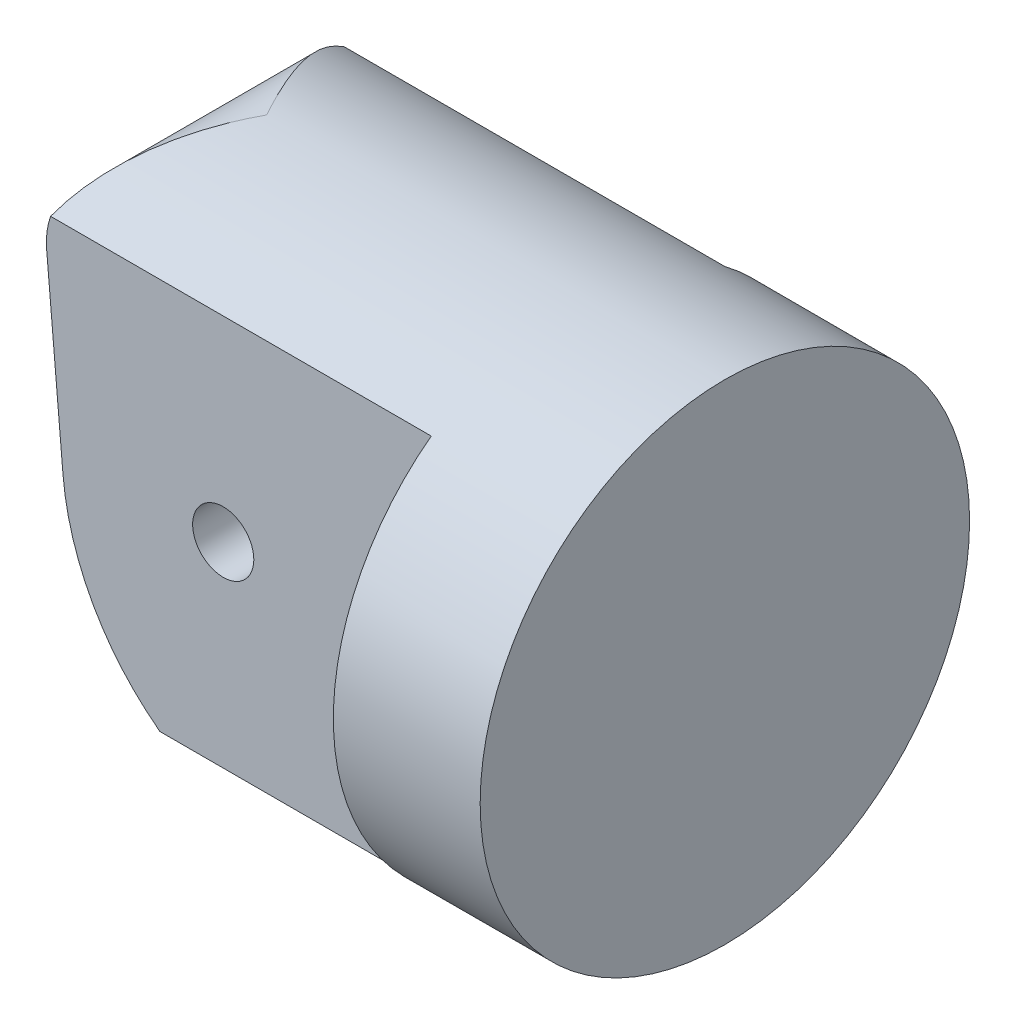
ISO-10303-21;
HEADER;
FILE_DESCRIPTION(('STEP AP214'),'2;1');
FILE_NAME('part.step','',(''),(''),'','','');
FILE_SCHEMA(('AUTOMOTIVE_DESIGN { 1 0 10303 214 1 1 1 1 }'));
ENDSEC;
DATA;
#1=APPLICATION_CONTEXT('core data for automotive mechanical design processes');
#2=APPLICATION_PROTOCOL_DEFINITION('international standard','automotive_design',2000,#1);
#3=PRODUCT_CONTEXT('',#1,'mechanical');
#4=PRODUCT('Part','Part','',(#3));
#5=PRODUCT_RELATED_PRODUCT_CATEGORY('part','',(#4));
#6=PRODUCT_DEFINITION_FORMATION('','',#4);
#7=PRODUCT_DEFINITION_CONTEXT('part definition',#1,'design');
#8=PRODUCT_DEFINITION('design','',#6,#7);
#9=PRODUCT_DEFINITION_SHAPE('','',#8);
#10=(LENGTH_UNIT() NAMED_UNIT(*) SI_UNIT(.MILLI.,.METRE.));
#11=(NAMED_UNIT(*) PLANE_ANGLE_UNIT() SI_UNIT($,.RADIAN.));
#12=(NAMED_UNIT(*) SI_UNIT($,.STERADIAN.) SOLID_ANGLE_UNIT());
#13=UNCERTAINTY_MEASURE_WITH_UNIT(LENGTH_MEASURE(1.E-05),#10,'distance_accuracy_value','');
#14=(GEOMETRIC_REPRESENTATION_CONTEXT(3) GLOBAL_UNCERTAINTY_ASSIGNED_CONTEXT((#13)) GLOBAL_UNIT_ASSIGNED_CONTEXT((#10,
#11,#12)) REPRESENTATION_CONTEXT('',''));
#15=CARTESIAN_POINT('',(0.,0.,0.));
#16=DIRECTION('',(0.,0.,1.));
#17=DIRECTION('',(1.,0.,0.));
#18=AXIS2_PLACEMENT_3D('',#15,#16,#17);
#19=CARTESIAN_POINT('',(-18.5,0.,-10.));
#20=DIRECTION('',(0.,0.,1.));
#21=DIRECTION('',(1.,0.,0.));
#22=AXIS2_PLACEMENT_3D('',#19,#20,#21);
#23=CYLINDRICAL_SURFACE('',#22,1.25);
#24=CARTESIAN_POINT('',(-18.5,0.,-3.));
#25=DIRECTION('',(0.,0.,-1.));
#26=DIRECTION('',(0.,1.,0.));
#27=AXIS2_PLACEMENT_3D('',#24,#25,#26);
#28=CIRCLE('',#27,1.25);
#29=CARTESIAN_POINT('',(-18.5,1.25,-3.));
#30=VERTEX_POINT('',#29);
#31=EDGE_CURVE('E169',#30,#30,#28,.F.);
#32=ORIENTED_EDGE('',*,*,#31,.T.);
#33=EDGE_LOOP('',(#32));
#34=FACE_BOUND('',#33,.T.);
#35=CARTESIAN_POINT('',(-18.5,0.,-6.));
#36=DIRECTION('',(0.,0.,1.));
#37=DIRECTION('',(1.,0.,0.));
#38=AXIS2_PLACEMENT_3D('',#35,#36,#37);
#39=CIRCLE('',#38,1.25);
#40=CARTESIAN_POINT('',(-17.25,0.,-6.));
#41=VERTEX_POINT('',#40);
#42=EDGE_CURVE('E235',#41,#41,#39,.T.);
#43=ORIENTED_EDGE('',*,*,#42,.F.);
#44=EDGE_LOOP('',(#43));
#45=FACE_BOUND('',#44,.T.);
#46=ADVANCED_FACE('F35',(#34,#45),#23,.F.);
#47=CARTESIAN_POINT('',(-25.7146585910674,6.73853277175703,-10.));
#48=DIRECTION('',(-0.996194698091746,-0.087155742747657,0.));
#49=DIRECTION('',(0.087155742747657,-0.996194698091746,0.));
#50=AXIS2_PLACEMENT_3D('',#47,#48,#49);
#51=PLANE('',#50);
#52=DIRECTION('',(0.087155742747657,-0.996194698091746,0.));
#53=VECTOR('',#52,1.);
#54=CARTESIAN_POINT('',(-25.7146585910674,6.73853277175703,-3.));
#55=LINE('',#54,#53);
#56=CARTESIAN_POINT('',(-25.7146585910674,6.73853277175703,-3.));
#57=VERTEX_POINT('',#56);
#58=CARTESIAN_POINT('',(-25.0488619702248,-0.871557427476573,-3.));
#59=VERTEX_POINT('',#58);
#60=EDGE_CURVE('E156',#57,#59,#55,.T.);
#61=ORIENTED_EDGE('',*,*,#60,.F.);
#62=DIRECTION('',(0.,0.,1.));
#63=VECTOR('',#62,1.);
#64=CARTESIAN_POINT('',(-25.7146585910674,6.73853277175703,-10.));
#65=LINE('',#64,#63);
#66=CARTESIAN_POINT('',(-25.7146585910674,6.73853277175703,-6.));
#67=VERTEX_POINT('',#66);
#68=EDGE_CURVE('E177',#67,#57,#65,.T.);
#69=ORIENTED_EDGE('',*,*,#68,.F.);
#70=DIRECTION('',(0.087155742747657,-0.996194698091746,0.));
#71=VECTOR('',#70,1.);
#72=CARTESIAN_POINT('',(-24.2635182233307,-9.84807753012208,-6.));
#73=LINE('',#72,#71);
#74=CARTESIAN_POINT('',(-25.0488619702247,-0.871557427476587,-6.));
#75=VERTEX_POINT('',#74);
#76=EDGE_CURVE('E251',#67,#75,#73,.T.);
#77=ORIENTED_EDGE('',*,*,#76,.T.);
#78=DIRECTION('',(0.,0.,1.));
#79=VECTOR('',#78,1.);
#80=CARTESIAN_POINT('',(-25.0488619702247,-0.871557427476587,-10.));
#81=LINE('',#80,#79);
#82=EDGE_CURVE('E173',#75,#59,#81,.T.);
#83=ORIENTED_EDGE('',*,*,#82,.T.);
#84=EDGE_LOOP('',(#61,#69,#77,#83));
#85=FACE_BOUND('',#84,.T.);
#86=ADVANCED_FACE('F225',(#85),#51,.T.);
#87=CARTESIAN_POINT('',(-26.,0.,0.));
#88=DIRECTION('',(1.,0.,0.));
#89=DIRECTION('',(0.,0.,-1.));
#90=AXIS2_PLACEMENT_3D('',#87,#88,#89);
#91=CYLINDRICAL_SURFACE('',#90,10.);
#92=CARTESIAN_POINT('',(-15.0869149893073,0.,0.));
#93=DIRECTION('',(0.707106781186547,0.,0.707106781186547));
#94=DIRECTION('',(0.707106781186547,0.,-0.707106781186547));
#95=AXIS2_PLACEMENT_3D('',#92,#93,#94);
#96=ELLIPSE('',#95,14.142135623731,10.);
#97=CARTESIAN_POINT('',(-21.0869149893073,-8.,6.));
#98=VERTEX_POINT('',#97);
#99=CARTESIAN_POINT('',(-15.0869149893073,-10.,0.));
#100=VERTEX_POINT('',#99);
#101=EDGE_CURVE('E243',#98,#100,#96,.T.);
#102=ORIENTED_EDGE('',*,*,#101,.T.);
#103=CARTESIAN_POINT('',(-15.0869149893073,0.,0.));
#104=DIRECTION('',(0.707106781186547,0.,-0.707106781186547));
#105=DIRECTION('',(0.707106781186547,0.,0.707106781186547));
#106=AXIS2_PLACEMENT_3D('',#103,#104,#105);
#107=ELLIPSE('',#106,14.142135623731,10.);
#108=CARTESIAN_POINT('',(-21.0869149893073,-8.,-6.));
#109=VERTEX_POINT('',#108);
#110=EDGE_CURVE('E256',#100,#109,#107,.T.);
#111=ORIENTED_EDGE('',*,*,#110,.T.);
#112=DIRECTION('',(1.,0.,0.));
#113=VECTOR('',#112,1.);
#114=CARTESIAN_POINT('',(-26.,-8.,-6.));
#115=LINE('',#114,#113);
#116=CARTESIAN_POINT('',(-9.99999999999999,-8.,-6.));
#117=VERTEX_POINT('',#116);
#118=EDGE_CURVE('E265',#117,#109,#115,.F.);
#119=ORIENTED_EDGE('',*,*,#118,.F.);
#120=CARTESIAN_POINT('',(-9.99999999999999,0.,0.));
#121=DIRECTION('',(-1.,0.,0.));
#122=DIRECTION('',(0.,0.,1.));
#123=AXIS2_PLACEMENT_3D('',#120,#121,#122);
#124=CIRCLE('',#123,10.);
#125=CARTESIAN_POINT('',(-9.99999999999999,8.,-6.));
#126=VERTEX_POINT('',#125);
#127=EDGE_CURVE('E247',#117,#126,#124,.F.);
#128=ORIENTED_EDGE('',*,*,#127,.T.);
#129=DIRECTION('',(1.,0.,0.));
#130=VECTOR('',#129,1.);
#131=CARTESIAN_POINT('',(-26.,8.,-6.));
#132=LINE('',#131,#130);
#133=CARTESIAN_POINT('',(-25.5545016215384,8.,-6.));
#134=VERTEX_POINT('',#133);
#135=EDGE_CURVE('E272',#134,#126,#132,.T.);
#136=ORIENTED_EDGE('',*,*,#135,.F.);
#137=CARTESIAN_POINT('',(-25.7146585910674,6.73853277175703,-7.38865184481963));
#138=CARTESIAN_POINT('',(-25.7228620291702,6.83244119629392,-7.30302593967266));
#139=CARTESIAN_POINT('',(-25.7265024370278,6.92486557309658,-7.21543631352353));
#140=CARTESIAN_POINT('',(-25.7255662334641,7.10618035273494,-7.03692315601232));
#141=CARTESIAN_POINT('',(-25.7209998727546,7.19507502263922,-6.94600392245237));
#142=CARTESIAN_POINT('',(-25.704634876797,7.36836828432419,-6.76188138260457));
#143=CARTESIAN_POINT('',(-25.6928891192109,7.4527948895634,-6.66869951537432));
#144=CARTESIAN_POINT('',(-25.6630049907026,7.61762260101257,-6.47978011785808));
#145=CARTESIAN_POINT('',(-25.6448635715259,7.69802176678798,-6.38404138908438));
#146=CARTESIAN_POINT('',(-25.5885092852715,7.90838990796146,-6.123844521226));
#147=CARTESIAN_POINT('',(-25.5450689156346,8.03447502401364,-5.9573540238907));
#148=CARTESIAN_POINT('',(-25.4450872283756,8.27430751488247,-5.61950272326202));
#149=CARTESIAN_POINT('',(-25.3885401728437,8.38804945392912,-5.44813981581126));
#150=CARTESIAN_POINT('',(-25.2644421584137,8.60382839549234,-5.1006083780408));
#151=CARTESIAN_POINT('',(-25.1968298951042,8.70579445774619,-4.92441790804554));
#152=CARTESIAN_POINT('',(-25.0528769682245,8.89745941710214,-4.56902472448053));
#153=CARTESIAN_POINT('',(-24.9765366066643,8.98715873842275,-4.38982211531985));
#154=CARTESIAN_POINT('',(-24.7801296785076,9.1930278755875,-3.94619285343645));
#155=CARTESIAN_POINT('',(-24.656072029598,9.30245864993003,-3.68039025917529));
#156=CARTESIAN_POINT('',(-24.3970450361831,9.4968151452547,-3.14509908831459));
#157=CARTESIAN_POINT('',(-24.2620698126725,9.58172754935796,-2.87560859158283));
#158=CARTESIAN_POINT('',(-23.984769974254,9.7276701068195,-2.33468530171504));
#159=CARTESIAN_POINT('',(-23.8424597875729,9.78874526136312,-2.06325716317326));
#160=CARTESIAN_POINT('',(-23.5530038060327,9.88783190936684,-1.5189643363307));
#161=CARTESIAN_POINT('',(-23.405860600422,9.92585554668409,-1.24610048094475));
#162=CARTESIAN_POINT('',(-23.171046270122,9.9681150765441,-0.813775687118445));
#163=CARTESIAN_POINT('',(-23.0842045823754,9.97982994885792,-0.654550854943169));
#164=CARTESIAN_POINT('',(-22.9101344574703,9.99562233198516,-0.336058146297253));
#165=CARTESIAN_POINT('',(-22.8229063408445,9.9997052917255,-0.17679038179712));
#166=CARTESIAN_POINT('',(-22.7324796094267,9.9999948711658,-0.0116940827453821));
#167=CARTESIAN_POINT('',(-22.7292770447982,9.99999999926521,-0.00584702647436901));
#168=CARTESIAN_POINT('',(-22.7260744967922,10.,0.));
#169=B_SPLINE_CURVE_WITH_KNOTS('',3,(#137,#138,#139,#140,#141,#142,#143,#144,#145,#146,#147,
#148,#149,#150,#151,#152,#153,#154,#155,#156,#157,#158,#159,#160,#161,#162,#163,#164,#165,#166,
#167,#168),.UNSPECIFIED.,.F.,.F.,(4,2,2,2,2,2,2,2,2,2,2,2,2,2,2,4),(0.,0.381844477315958,
0.763212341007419,1.14180464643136,1.52057763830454,2.1595204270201,2.79874346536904,
3.44163595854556,4.08450621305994,5.02235097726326,5.96070416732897,6.8972772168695,
7.83335643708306,8.37845947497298,8.92317317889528,8.94317318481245),.UNSPECIFIED.);
#170=CARTESIAN_POINT('',(-22.7260744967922,10.,0.));
#171=VERTEX_POINT('',#170);
#172=EDGE_CURVE('E59',#134,#171,#169,.T.);
#173=ORIENTED_EDGE('',*,*,#172,.T.);
#174=CARTESIAN_POINT('',(-25.7146585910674,6.73853277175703,7.38865184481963));
#175=CARTESIAN_POINT('',(-25.7228620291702,6.83244119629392,7.30302593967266));
#176=CARTESIAN_POINT('',(-25.7265024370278,6.92486557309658,7.21543631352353));
#177=CARTESIAN_POINT('',(-25.7255662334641,7.10618035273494,7.03692315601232));
#178=CARTESIAN_POINT('',(-25.7209998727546,7.19507502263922,6.94600392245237));
#179=CARTESIAN_POINT('',(-25.704634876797,7.36836828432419,6.76188138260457));
#180=CARTESIAN_POINT('',(-25.6928891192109,7.4527948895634,6.66869951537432));
#181=CARTESIAN_POINT('',(-25.6630049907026,7.61762260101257,6.47978011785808));
#182=CARTESIAN_POINT('',(-25.6448635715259,7.69802176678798,6.38404138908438));
#183=CARTESIAN_POINT('',(-25.5885092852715,7.90838990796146,6.123844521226));
#184=CARTESIAN_POINT('',(-25.5450689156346,8.03447502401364,5.9573540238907));
#185=CARTESIAN_POINT('',(-25.4450872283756,8.27430751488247,5.61950272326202));
#186=CARTESIAN_POINT('',(-25.3885401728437,8.38804945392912,5.44813981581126));
#187=CARTESIAN_POINT('',(-25.2644421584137,8.60382839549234,5.1006083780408));
#188=CARTESIAN_POINT('',(-25.1968298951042,8.70579445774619,4.92441790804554));
#189=CARTESIAN_POINT('',(-25.0528769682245,8.89745941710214,4.56902472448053));
#190=CARTESIAN_POINT('',(-24.9765366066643,8.98715873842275,4.38982211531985));
#191=CARTESIAN_POINT('',(-24.7801296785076,9.1930278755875,3.94619285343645));
#192=CARTESIAN_POINT('',(-24.656072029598,9.30245864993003,3.68039025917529));
#193=CARTESIAN_POINT('',(-24.3970450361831,9.4968151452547,3.14509908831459));
#194=CARTESIAN_POINT('',(-24.2620698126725,9.58172754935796,2.87560859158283));
#195=CARTESIAN_POINT('',(-23.984769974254,9.7276701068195,2.33468530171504));
#196=CARTESIAN_POINT('',(-23.8424597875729,9.78874526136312,2.06325716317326));
#197=CARTESIAN_POINT('',(-23.5530038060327,9.88783190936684,1.5189643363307));
#198=CARTESIAN_POINT('',(-23.405860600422,9.92585554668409,1.24610048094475));
#199=CARTESIAN_POINT('',(-23.171046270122,9.9681150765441,0.813775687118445));
#200=CARTESIAN_POINT('',(-23.0842045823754,9.97982994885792,0.654550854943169));
#201=CARTESIAN_POINT('',(-22.9101344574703,9.99562233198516,0.336058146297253));
#202=CARTESIAN_POINT('',(-22.8229063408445,9.9997052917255,0.17679038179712));
#203=CARTESIAN_POINT('',(-22.7324796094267,9.9999948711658,0.0116940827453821));
#204=CARTESIAN_POINT('',(-22.7292770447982,9.99999999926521,0.00584702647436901));
#205=CARTESIAN_POINT('',(-22.7260744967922,10.,0.));
#206=B_SPLINE_CURVE_WITH_KNOTS('',3,(#174,#175,#176,#177,#178,#179,#180,#181,#182,#183,#184,
#185,#186,#187,#188,#189,#190,#191,#192,#193,#194,#195,#196,#197,#198,#199,#200,#201,#202,#203,
#204,#205),.UNSPECIFIED.,.F.,.F.,(4,2,2,2,2,2,2,2,2,2,2,2,2,2,2,4),(0.,0.381844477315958,
0.763212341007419,1.14180464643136,1.52057763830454,2.1595204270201,2.79874346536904,
3.44163595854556,4.08450621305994,5.02235097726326,5.96070416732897,6.8972772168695,
7.83335643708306,8.37845947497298,8.92317317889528,8.94317318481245),.UNSPECIFIED.);
#207=CARTESIAN_POINT('',(-25.5545016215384,8.,6.));
#208=VERTEX_POINT('',#207);
#209=EDGE_CURVE('E185',#171,#208,#206,.F.);
#210=ORIENTED_EDGE('',*,*,#209,.T.);
#211=DIRECTION('',(1.,0.,0.));
#212=VECTOR('',#211,1.);
#213=CARTESIAN_POINT('',(-26.,8.,6.));
#214=LINE('',#213,#212);
#215=CARTESIAN_POINT('',(-10.,8.,6.));
#216=VERTEX_POINT('',#215);
#217=EDGE_CURVE('E275',#208,#216,#214,.T.);
#218=ORIENTED_EDGE('',*,*,#217,.T.);
#219=CARTESIAN_POINT('',(-9.99999999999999,0.,0.));
#220=DIRECTION('',(1.,0.,0.));
#221=DIRECTION('',(0.,0.,-1.));
#222=AXIS2_PLACEMENT_3D('',#219,#220,#221);
#223=CIRCLE('',#222,10.);
#224=CARTESIAN_POINT('',(-10.,-8.,6.));
#225=VERTEX_POINT('',#224);
#226=EDGE_CURVE('E284',#225,#216,#223,.F.);
#227=ORIENTED_EDGE('',*,*,#226,.F.);
#228=DIRECTION('',(1.,0.,0.));
#229=VECTOR('',#228,1.);
#230=CARTESIAN_POINT('',(-26.,-8.,6.));
#231=LINE('',#230,#229);
#232=EDGE_CURVE('E281',#225,#98,#231,.F.);
#233=ORIENTED_EDGE('',*,*,#232,.T.);
#234=EDGE_LOOP('',(#102,#111,#119,#128,#136,#173,#210,#218,#227,#233));
#235=FACE_BOUND('',#234,.T.);
#236=CARTESIAN_POINT('',(-4.,0.,0.));
#237=DIRECTION('',(1.,0.,0.));
#238=DIRECTION('',(0.,0.,-1.));
#239=AXIS2_PLACEMENT_3D('',#236,#237,#238);
#240=CIRCLE('',#239,10.);
#241=CARTESIAN_POINT('',(-4.,0.,-10.));
#242=VERTEX_POINT('',#241);
#243=EDGE_CURVE('E283',#242,#242,#240,.T.);
#244=ORIENTED_EDGE('',*,*,#243,.F.);
#245=EDGE_LOOP('',(#244));
#246=FACE_BOUND('',#245,.T.);
#247=ADVANCED_FACE('F37',(#235,#246),#91,.T.);
#248=CARTESIAN_POINT('',(-26.,-10.,6.));
#249=DIRECTION('',(0.,0.,1.));
#250=DIRECTION('',(1.,0.,0.));
#251=AXIS2_PLACEMENT_3D('',#248,#249,#250);
#252=PLANE('',#251);
#253=CARTESIAN_POINT('',(-18.5,0.,6.));
#254=DIRECTION('',(0.,0.,1.));
#255=DIRECTION('',(1.,0.,0.));
#256=AXIS2_PLACEMENT_3D('',#253,#254,#255);
#257=CIRCLE('',#256,1.25);
#258=CARTESIAN_POINT('',(-17.25,0.,6.));
#259=VERTEX_POINT('',#258);
#260=EDGE_CURVE('E236',#259,#259,#257,.T.);
#261=ORIENTED_EDGE('',*,*,#260,.F.);
#262=EDGE_LOOP('',(#261));
#263=FACE_BOUND('',#262,.T.);
#264=DIRECTION('',(0.087155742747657,-0.996194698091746,0.));
#265=VECTOR('',#264,1.);
#266=CARTESIAN_POINT('',(-24.2635182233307,-9.84807753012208,6.));
#267=LINE('',#266,#265);
#268=CARTESIAN_POINT('',(-25.7146585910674,6.73853277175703,6.));
#269=VERTEX_POINT('',#268);
#270=CARTESIAN_POINT('',(-25.0488619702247,-0.871557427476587,6.));
#271=VERTEX_POINT('',#270);
#272=EDGE_CURVE('E267',#269,#271,#267,.T.);
#273=ORIENTED_EDGE('',*,*,#272,.T.);
#274=CARTESIAN_POINT('',(-15.0869149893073,0.,6.));
#275=DIRECTION('',(0.,0.,1.));
#276=DIRECTION('',(1.,0.,0.));
#277=AXIS2_PLACEMENT_3D('',#274,#275,#276);
#278=CIRCLE('',#277,10.);
#279=EDGE_CURVE('E237',#271,#98,#278,.T.);
#280=ORIENTED_EDGE('',*,*,#279,.T.);
#281=ORIENTED_EDGE('',*,*,#232,.F.);
#282=DIRECTION('',(0.,1.,0.));
#283=VECTOR('',#282,1.);
#284=CARTESIAN_POINT('',(-9.99999999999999,-10.,6.));
#285=LINE('',#284,#283);
#286=EDGE_CURVE('E271',#225,#216,#285,.T.);
#287=ORIENTED_EDGE('',*,*,#286,.T.);
#288=ORIENTED_EDGE('',*,*,#217,.F.);
#289=CARTESIAN_POINT('',(-22.7260744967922,7.,6.));
#290=DIRECTION('',(0.,0.,1.));
#291=DIRECTION('',(1.,0.,0.));
#292=AXIS2_PLACEMENT_3D('',#289,#290,#291);
#293=CIRCLE('',#292,3.);
#294=EDGE_CURVE('E291',#208,#269,#293,.T.);
#295=ORIENTED_EDGE('',*,*,#294,.T.);
#296=EDGE_LOOP('',(#273,#280,#281,#287,#288,#295));
#297=FACE_BOUND('',#296,.T.);
#298=ADVANCED_FACE('F212',(#263,#297),#252,.T.);
#299=CARTESIAN_POINT('',(-26.,-10.,-6.));
#300=DIRECTION('',(0.,0.,1.));
#301=DIRECTION('',(1.,0.,0.));
#302=AXIS2_PLACEMENT_3D('',#299,#300,#301);
#303=PLANE('',#302);
#304=ORIENTED_EDGE('',*,*,#42,.T.);
#305=EDGE_LOOP('',(#304));
#306=FACE_BOUND('',#305,.T.);
#307=CARTESIAN_POINT('',(-15.0869149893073,0.,-6.));
#308=DIRECTION('',(0.,0.,1.));
#309=DIRECTION('',(1.,0.,0.));
#310=AXIS2_PLACEMENT_3D('',#307,#308,#309);
#311=CIRCLE('',#310,10.);
#312=EDGE_CURVE('E44',#75,#109,#311,.T.);
#313=ORIENTED_EDGE('',*,*,#312,.F.);
#314=ORIENTED_EDGE('',*,*,#76,.F.);
#315=CARTESIAN_POINT('',(-22.7260744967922,7.,-6.));
#316=DIRECTION('',(0.,0.,1.));
#317=DIRECTION('',(1.,0.,0.));
#318=AXIS2_PLACEMENT_3D('',#315,#316,#317);
#319=CIRCLE('',#318,3.);
#320=EDGE_CURVE('E249',#134,#67,#319,.T.);
#321=ORIENTED_EDGE('',*,*,#320,.F.);
#322=ORIENTED_EDGE('',*,*,#135,.T.);
#323=DIRECTION('',(0.,1.,0.));
#324=VECTOR('',#323,1.);
#325=CARTESIAN_POINT('',(-9.99999999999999,-10.,-6.));
#326=LINE('',#325,#324);
#327=EDGE_CURVE('E240',#117,#126,#326,.T.);
#328=ORIENTED_EDGE('',*,*,#327,.F.);
#329=ORIENTED_EDGE('',*,*,#118,.T.);
#330=EDGE_LOOP('',(#313,#314,#321,#322,#328,#329));
#331=FACE_BOUND('',#330,.T.);
#332=ADVANCED_FACE('F208',(#306,#331),#303,.F.);
#333=CARTESIAN_POINT('',(-4.,0.,0.));
#334=DIRECTION('',(1.,0.,0.));
#335=DIRECTION('',(0.,0.,-1.));
#336=AXIS2_PLACEMENT_3D('',#333,#334,#335);
#337=PLANE('',#336);
#338=ORIENTED_EDGE('',*,*,#243,.T.);
#339=EDGE_LOOP('',(#338));
#340=FACE_BOUND('',#339,.T.);
#341=ADVANCED_FACE('F211',(#340),#337,.T.);
#342=CARTESIAN_POINT('',(-10.,-10.,10.));
#343=DIRECTION('',(1.,0.,0.));
#344=DIRECTION('',(0.,0.,-1.));
#345=AXIS2_PLACEMENT_3D('',#342,#343,#344);
#346=PLANE('',#345);
#347=ORIENTED_EDGE('',*,*,#286,.F.);
#348=ORIENTED_EDGE('',*,*,#226,.T.);
#349=EDGE_LOOP('',(#347,#348));
#350=FACE_BOUND('',#349,.T.);
#351=ADVANCED_FACE('F206',(#350),#346,.F.);
#352=CARTESIAN_POINT('',(-10.,-10.,-10.));
#353=DIRECTION('',(-1.,0.,0.));
#354=DIRECTION('',(0.,0.,1.));
#355=AXIS2_PLACEMENT_3D('',#352,#353,#354);
#356=PLANE('',#355);
#357=ORIENTED_EDGE('',*,*,#327,.T.);
#358=ORIENTED_EDGE('',*,*,#127,.F.);
#359=EDGE_LOOP('',(#357,#358));
#360=FACE_BOUND('',#359,.T.);
#361=ADVANCED_FACE('F202',(#360),#356,.T.);
#362=CARTESIAN_POINT('',(-18.5,0.,3.));
#363=DIRECTION('',(0.,0.,1.));
#364=DIRECTION('',(0.,-1.,0.));
#365=AXIS2_PLACEMENT_3D('',#362,#363,#364);
#366=CIRCLE('',#365,1.25);
#367=CARTESIAN_POINT('',(-18.5,-1.25,3.));
#368=VERTEX_POINT('',#367);
#369=EDGE_CURVE('E165',#368,#368,#366,.F.);
#370=ORIENTED_EDGE('',*,*,#369,.T.);
#371=EDGE_LOOP('',(#370));
#372=FACE_BOUND('',#371,.T.);
#373=ORIENTED_EDGE('',*,*,#260,.T.);
#374=EDGE_LOOP('',(#373));
#375=FACE_BOUND('',#374,.T.);
#376=ADVANCED_FACE('F198',(#372,#375),#23,.F.);
#377=DIRECTION('',(-0.087155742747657,0.996194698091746,0.));
#378=VECTOR('',#377,1.);
#379=CARTESIAN_POINT('',(-25.7146585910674,6.73853277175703,3.));
#380=LINE('',#379,#378);
#381=CARTESIAN_POINT('',(-25.0488619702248,-0.871557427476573,3.));
#382=VERTEX_POINT('',#381);
#383=CARTESIAN_POINT('',(-25.7146585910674,6.73853277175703,3.));
#384=VERTEX_POINT('',#383);
#385=EDGE_CURVE('E151',#382,#384,#380,.T.);
#386=ORIENTED_EDGE('',*,*,#385,.F.);
#387=EDGE_CURVE('E176',#382,#271,#81,.T.);
#388=ORIENTED_EDGE('',*,*,#387,.T.);
#389=ORIENTED_EDGE('',*,*,#272,.F.);
#390=EDGE_CURVE('E172',#384,#269,#65,.T.);
#391=ORIENTED_EDGE('',*,*,#390,.F.);
#392=EDGE_LOOP('',(#386,#388,#389,#391));
#393=FACE_BOUND('',#392,.T.);
#394=ADVANCED_FACE('F196',(#393),#51,.T.);
#395=CARTESIAN_POINT('',(-15.0869149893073,0.,-10.));
#396=DIRECTION('',(0.,0.,1.));
#397=DIRECTION('',(1.,0.,0.));
#398=AXIS2_PLACEMENT_3D('',#395,#396,#397);
#399=CYLINDRICAL_SURFACE('',#398,10.);
#400=CARTESIAN_POINT('',(-15.0869149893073,0.,-3.));
#401=DIRECTION('',(0.,0.,-1.));
#402=DIRECTION('',(0.,1.,0.));
#403=AXIS2_PLACEMENT_3D('',#400,#401,#402);
#404=CIRCLE('',#403,10.);
#405=CARTESIAN_POINT('',(-22.21936653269,-7.00914652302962,-3.));
#406=VERTEX_POINT('',#405);
#407=EDGE_CURVE('E133',#59,#406,#404,.F.);
#408=ORIENTED_EDGE('',*,*,#407,.F.);
#409=ORIENTED_EDGE('',*,*,#82,.F.);
#410=ORIENTED_EDGE('',*,*,#312,.T.);
#411=ORIENTED_EDGE('',*,*,#110,.F.);
#412=ORIENTED_EDGE('',*,*,#101,.F.);
#413=ORIENTED_EDGE('',*,*,#279,.F.);
#414=ORIENTED_EDGE('',*,*,#387,.F.);
#415=CARTESIAN_POINT('',(-15.0869149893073,0.,3.));
#416=DIRECTION('',(0.,0.,1.));
#417=DIRECTION('',(0.,-1.,0.));
#418=AXIS2_PLACEMENT_3D('',#415,#416,#417);
#419=CIRCLE('',#418,10.);
#420=CARTESIAN_POINT('',(-22.21936653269,-7.00914652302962,3.));
#421=VERTEX_POINT('',#420);
#422=EDGE_CURVE('E161',#421,#382,#419,.F.);
#423=ORIENTED_EDGE('',*,*,#422,.F.);
#424=DIRECTION('',(0.,0.,1.));
#425=VECTOR('',#424,1.);
#426=CARTESIAN_POINT('',(-22.21936653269,-7.00914652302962,-10.));
#427=LINE('',#426,#425);
#428=EDGE_CURVE('E12',#406,#421,#427,.T.);
#429=ORIENTED_EDGE('',*,*,#428,.F.);
#430=EDGE_LOOP('',(#408,#409,#410,#411,#412,#413,#414,#423,#429));
#431=FACE_BOUND('',#430,.T.);
#432=ADVANCED_FACE('F195',(#431),#399,.T.);
#433=CARTESIAN_POINT('',(-22.7260744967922,7.,-10.));
#434=DIRECTION('',(0.,0.,1.));
#435=DIRECTION('',(1.,0.,0.));
#436=AXIS2_PLACEMENT_3D('',#433,#434,#435);
#437=CYLINDRICAL_SURFACE('',#436,3.);
#438=ORIENTED_EDGE('',*,*,#209,.F.);
#439=ORIENTED_EDGE('',*,*,#172,.F.);
#440=ORIENTED_EDGE('',*,*,#320,.T.);
#441=ORIENTED_EDGE('',*,*,#68,.T.);
#442=DIRECTION('',(0.,0.,-1.));
#443=VECTOR('',#442,1.);
#444=CARTESIAN_POINT('',(-25.7146585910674,6.73853277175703,-3.));
#445=LINE('',#444,#443);
#446=EDGE_CURVE('E149',#384,#57,#445,.T.);
#447=ORIENTED_EDGE('',*,*,#446,.F.);
#448=ORIENTED_EDGE('',*,*,#390,.T.);
#449=ORIENTED_EDGE('',*,*,#294,.F.);
#450=EDGE_LOOP('',(#438,#439,#440,#441,#447,#448,#449));
#451=FACE_BOUND('',#450,.T.);
#452=ADVANCED_FACE('F190',(#451),#437,.T.);
#453=CARTESIAN_POINT('',(-13.7603222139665,7.78440168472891,-3.));
#454=DIRECTION('',(0.,0.,-1.));
#455=DIRECTION('',(0.,1.,0.));
#456=AXIS2_PLACEMENT_3D('',#453,#454,#455);
#457=PLANE('',#456);
#458=ORIENTED_EDGE('',*,*,#407,.T.);
#459=DIRECTION('',(-0.996194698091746,-0.087155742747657,0.));
#460=VECTOR('',#459,1.);
#461=CARTESIAN_POINT('',(-12.5401418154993,-6.16232408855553,-3.));
#462=LINE('',#461,#460);
#463=CARTESIAN_POINT('',(-12.5401418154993,-6.16232408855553,-3.));
#464=VERTEX_POINT('',#463);
#465=EDGE_CURVE('E125',#464,#406,#462,.T.);
#466=ORIENTED_EDGE('',*,*,#465,.F.);
#467=DIRECTION('',(0.087155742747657,-0.996194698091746,0.));
#468=VECTOR('',#467,1.);
#469=CARTESIAN_POINT('',(-13.7603222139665,7.78440168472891,-3.));
#470=LINE('',#469,#468);
#471=CARTESIAN_POINT('',(-13.7603222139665,7.78440168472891,-3.));
#472=VERTEX_POINT('',#471);
#473=EDGE_CURVE('E130',#472,#464,#470,.T.);
#474=ORIENTED_EDGE('',*,*,#473,.F.);
#475=DIRECTION('',(-0.996194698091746,-0.087155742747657,0.));
#476=VECTOR('',#475,1.);
#477=CARTESIAN_POINT('',(-13.7603222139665,7.78440168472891,-3.));
#478=LINE('',#477,#476);
#479=EDGE_CURVE('E159',#472,#57,#478,.T.);
#480=ORIENTED_EDGE('',*,*,#479,.T.);
#481=ORIENTED_EDGE('',*,*,#60,.T.);
#482=EDGE_LOOP('',(#458,#466,#474,#480,#481));
#483=FACE_BOUND('',#482,.T.);
#484=ORIENTED_EDGE('',*,*,#31,.F.);
#485=EDGE_LOOP('',(#484));
#486=FACE_BOUND('',#485,.T.);
#487=ADVANCED_FACE('F127',(#483,#486),#457,.F.);
#488=CARTESIAN_POINT('',(-13.7603222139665,7.78440168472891,3.));
#489=DIRECTION('',(0.,0.,1.));
#490=DIRECTION('',(0.,-1.,0.));
#491=AXIS2_PLACEMENT_3D('',#488,#489,#490);
#492=PLANE('',#491);
#493=ORIENTED_EDGE('',*,*,#422,.T.);
#494=ORIENTED_EDGE('',*,*,#385,.T.);
#495=DIRECTION('',(-0.996194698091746,-0.087155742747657,0.));
#496=VECTOR('',#495,1.);
#497=CARTESIAN_POINT('',(-13.7603222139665,7.78440168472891,3.));
#498=LINE('',#497,#496);
#499=CARTESIAN_POINT('',(-13.7603222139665,7.78440168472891,3.));
#500=VERTEX_POINT('',#499);
#501=EDGE_CURVE('E51',#500,#384,#498,.T.);
#502=ORIENTED_EDGE('',*,*,#501,.F.);
#503=DIRECTION('',(-0.087155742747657,0.996194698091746,0.));
#504=VECTOR('',#503,1.);
#505=CARTESIAN_POINT('',(-13.7603222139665,7.78440168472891,3.));
#506=LINE('',#505,#504);
#507=CARTESIAN_POINT('',(-12.5401418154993,-6.16232408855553,3.));
#508=VERTEX_POINT('',#507);
#509=EDGE_CURVE('E146',#508,#500,#506,.T.);
#510=ORIENTED_EDGE('',*,*,#509,.F.);
#511=DIRECTION('',(-0.996194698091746,-0.087155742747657,0.));
#512=VECTOR('',#511,1.);
#513=CARTESIAN_POINT('',(-12.5401418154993,-6.16232408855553,3.));
#514=LINE('',#513,#512);
#515=EDGE_CURVE('E136',#508,#421,#514,.T.);
#516=ORIENTED_EDGE('',*,*,#515,.T.);
#517=EDGE_LOOP('',(#493,#494,#502,#510,#516));
#518=FACE_BOUND('',#517,.T.);
#519=ORIENTED_EDGE('',*,*,#369,.F.);
#520=EDGE_LOOP('',(#519));
#521=FACE_BOUND('',#520,.T.);
#522=ADVANCED_FACE('F306',(#518,#521),#492,.F.);
#523=CARTESIAN_POINT('',(-13.7603222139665,7.78440168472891,-3.));
#524=DIRECTION('',(-0.087155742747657,0.996194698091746,0.));
#525=DIRECTION('',(-0.996194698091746,-0.087155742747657,0.));
#526=AXIS2_PLACEMENT_3D('',#523,#524,#525);
#527=PLANE('',#526);
#528=ORIENTED_EDGE('',*,*,#446,.T.);
#529=ORIENTED_EDGE('',*,*,#479,.F.);
#530=DIRECTION('',(0.,0.,-1.));
#531=VECTOR('',#530,1.);
#532=CARTESIAN_POINT('',(-13.7603222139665,7.78440168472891,-3.));
#533=LINE('',#532,#531);
#534=EDGE_CURVE('E137',#500,#472,#533,.T.);
#535=ORIENTED_EDGE('',*,*,#534,.F.);
#536=ORIENTED_EDGE('',*,*,#501,.T.);
#537=EDGE_LOOP('',(#528,#529,#535,#536));
#538=FACE_BOUND('',#537,.T.);
#539=ADVANCED_FACE('F308',(#538),#527,.F.);
#540=CARTESIAN_POINT('',(-12.5401418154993,-6.16232408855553,-3.));
#541=DIRECTION('',(0.087155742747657,-0.996194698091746,0.));
#542=DIRECTION('',(0.996194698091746,0.087155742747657,0.));
#543=AXIS2_PLACEMENT_3D('',#540,#541,#542);
#544=PLANE('',#543);
#545=ORIENTED_EDGE('',*,*,#428,.T.);
#546=ORIENTED_EDGE('',*,*,#515,.F.);
#547=DIRECTION('',(0.,0.,1.));
#548=VECTOR('',#547,1.);
#549=CARTESIAN_POINT('',(-12.5401418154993,-6.16232408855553,-3.));
#550=LINE('',#549,#548);
#551=EDGE_CURVE('E140',#464,#508,#550,.T.);
#552=ORIENTED_EDGE('',*,*,#551,.F.);
#553=ORIENTED_EDGE('',*,*,#465,.T.);
#554=EDGE_LOOP('',(#545,#546,#552,#553));
#555=FACE_BOUND('',#554,.T.);
#556=ADVANCED_FACE('F141',(#555),#544,.F.);
#557=CARTESIAN_POINT('',(-12.9799235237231,-1.13559616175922,0.));
#558=DIRECTION('',(-0.996194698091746,-0.087155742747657,0.));
#559=DIRECTION('',(0.087155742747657,-0.996194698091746,0.));
#560=AXIS2_PLACEMENT_3D('',#557,#558,#559);
#561=PLANE('',#560);
#562=ORIENTED_EDGE('',*,*,#473,.T.);
#563=ORIENTED_EDGE('',*,*,#551,.T.);
#564=ORIENTED_EDGE('',*,*,#509,.T.);
#565=ORIENTED_EDGE('',*,*,#534,.T.);
#566=EDGE_LOOP('',(#562,#563,#564,#565));
#567=FACE_BOUND('',#566,.T.);
#568=ADVANCED_FACE('F148',(#567),#561,.T.);
#569=CLOSED_SHELL('',(#46,#86,#247,#298,#332,#341,#351,#361,#376,#394,#432,#452,#487,#522,#539,
#556,#568));
#570=MANIFOLD_SOLID_BREP('B2',#569);
#571=ADVANCED_BREP_SHAPE_REPRESENTATION('',(#18,#570),#14);
#572=SHAPE_DEFINITION_REPRESENTATION(#9,#571);
ENDSEC;
END-ISO-10303-21;
